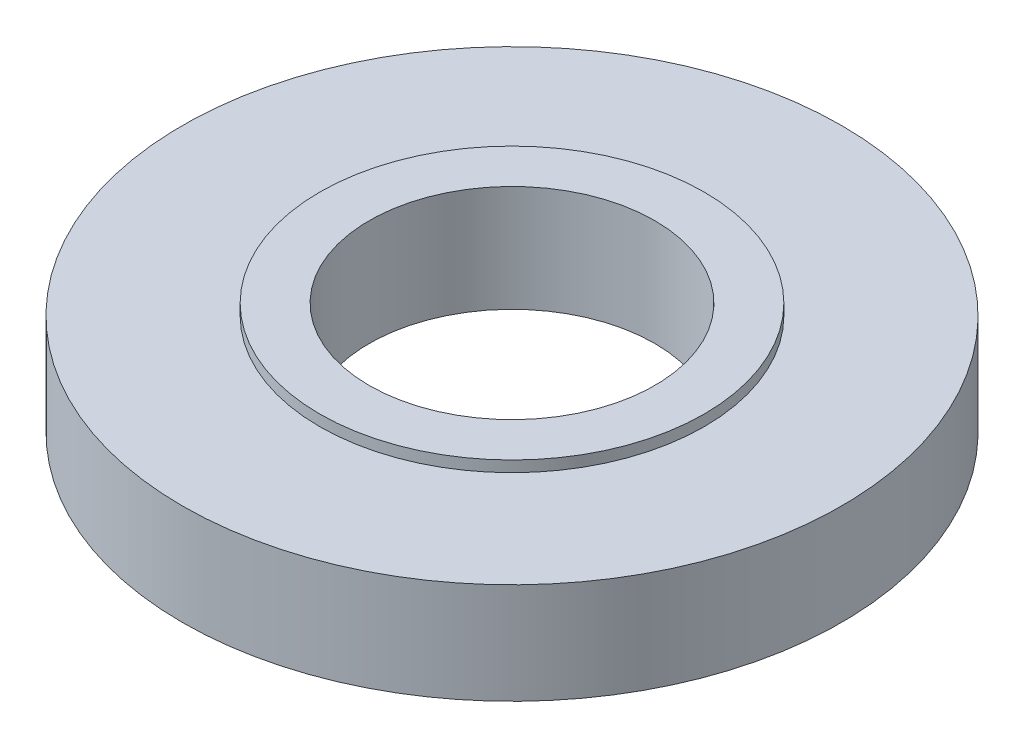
from build123d import *


with BuildPart() as part:
    # Schizzo1 → Rivoluzione1 (revolve)
    with BuildSketch(Plane.XY, mode=Mode.PRIVATE) as rivoluzione1_sk:
        Polygon((17.5, 0), (13, 0), (13, 9.687556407), (17.5, 9.687556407), (17.5, 8.687556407), (30, 8.687556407), (30, -0.5), (25.5, -0.5), (25.5, 0.5), (17.5, 0.5), align=None)
    revolve(rivoluzione1_sk.sketch.rotate(Axis((0, 46.891895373, 0), (0, -1, 0)), 90), axis=Axis((0, 46.891895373, 0), (0, -1, 0)))


solid = part.part
